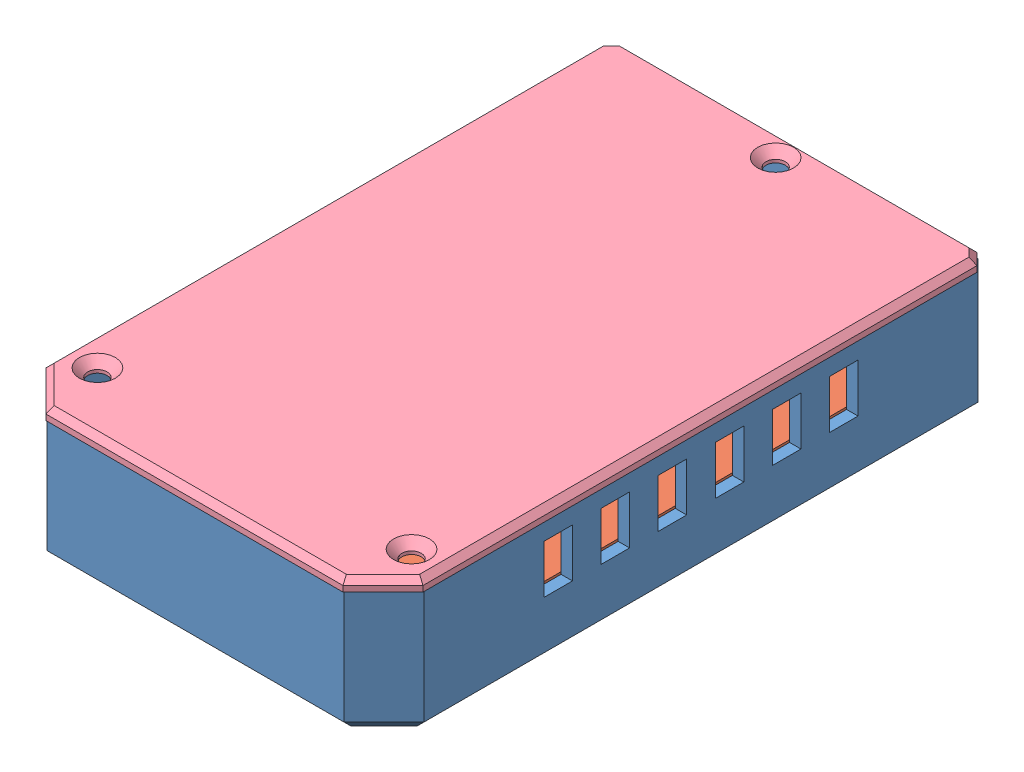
SolidWorks assembly Main Assembly.SLDASM, configuration Default (file format 11000). Lengths in mm.
Overall size (66.01 23.8 106.18).
5 component instances, 4 part files, 4 mates.
Components (placement in the parent):
- Case main-1: Case main.SLDPRT [Default] at (-33.6303 -12.1006 15.5035) size (66 21.8 106)
- PCB Assembly-1: PCB Assembly.SLDASM [Default] at (-51.7413 -1.812 9.1469) x (-1 0 0) z (0 0 1) size (60 12.5 95)
  - PCB-1: PCB.SLDPRT [Default] at (-18.111 0.4886 7.3567) size (60 12.5 95)
  - Display-1: Display.SLDPRT [Default] at (-17.861 1.4886 6.8567) size (50 8 85)
- Cover-1: Cover.SLDPRT [Default] at (-33.6219 9.6994 19.1855) size (66 2 106)
Mates (geometry in assembly coordinates):
- Concentric1: concentric: circle of Case main-1; circle of PCB Assembly-1/PCB-1
- Coincident2: coincident: plane of Case main-1 through (-33.6303 -7.3006 15.5035) normal (0 1 0); plane of PCB Assembly-1/Display-1 through (-33.8803 -7.3006 16.0035) normal (0 -1 0)
- Concentric2: concentric: circle of Case main-1; circle of PCB Assembly-1/PCB-1
- Coincident3: coincident: plane of Case main-1 through (-33.6303 9.6994 15.5035) normal (0 1 0); plane of Cover-1 through (-33.6219 9.6994 19.1855) normal (0 -1 0)
